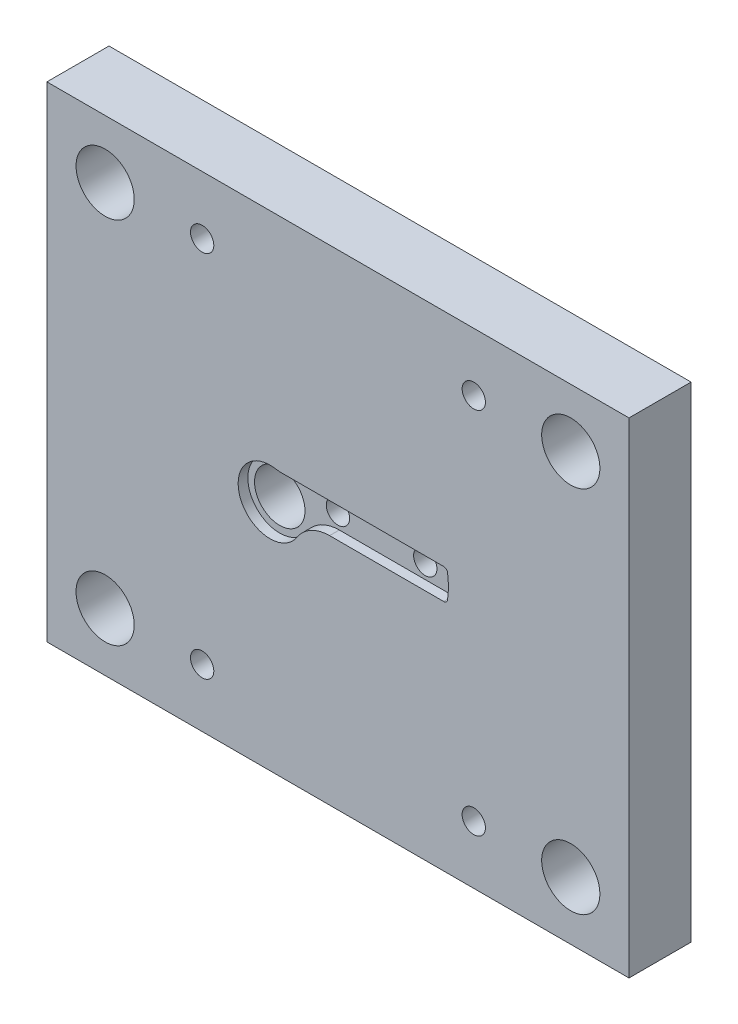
from build123d import *

# Parameters (mm, degrees)
ESQUISSE1_W              = 300
ESQUISSE1_H              = 250
BASE_EXTRUSION_DEPTH     = 32
ENL_V_MAT_EXTRU_1_DEPTH  = 5
ESQUISSE3_R              = 13
ENL_V_MAT_EXTRU_2_DEPTH  = 392.444759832
ESQUISSE6_R              = 6
ENL_V_MAT_EXTRU_5_DEPTH  = 13
ESQUISSE7_R              = 9
ENL_V_MAT_EXTRU_6_DEPTH  = 391.927103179
ESQUISSE8_R              = 15
ENL_V_MAT_EXTRU_7_DEPTH  = 22
ESQUISSE9_R              = 23
ENL_V_MAT_EXTRU_8_DEPTH  = 392.131691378
ESQUISSE10_R             = 10
ENL_V_MAT_EXTRU_9_DEPTH  = 21.5
ESQUISSE11_R             = 6
ENL_V_MAT_EXTRU_10_DEPTH = 392.103886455


with BuildPart() as part:
    # Esquisse1 → Base-Extrusion (new body)
    with BuildSketch(Plane.XY):
        with Locations((150, 125)):
            Rectangle(ESQUISSE1_W, ESQUISSE1_H)
    extrude(amount=BASE_EXTRUSION_DEPTH)

    # Esquisse2 → Enl_v. mat.-Extru.1 (cut)
    with BuildSketch(Plane.XY.offset(32)):
        with BuildLine():
            Line((121.07819052, 135.935), (204.489847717, 135.935))
            ThreePointArc((204.489847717, 135.935), (205.861295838, 135.401672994), (206.512122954, 134.081926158))
            Line((206.512122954, 134.081926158), (207.033723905, 128.12))
            Line((207.033723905, 128.12), (206.512122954, 122.158073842))
            ThreePointArc((206.512122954, 122.158073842), (205.861295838, 120.838327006), (204.489847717, 120.305))
            Line((204.489847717, 120.305), (145.681427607, 120.305))
            ThreePointArc((145.681427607, 120.305), (136.083538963, 117.855711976), (128.832928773, 111.106850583))
            ThreePointArc((128.832928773, 111.106850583), (99.957582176, 113.354423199), (117.740393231, 136.215063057))
            ThreePointArc((117.740393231, 136.215063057), (119.403427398, 136.005138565), (121.07819052, 135.935))
        make_face()
    extrude(amount=-ENL_V_MAT_EXTRU_1_DEPTH, mode=Mode.SUBTRACT)

    # Esquisse3 → Enl_v. mat.-Extru.2 (cut, through all)
    with BuildSketch(Plane.XY.offset(27)):
        with Locations((115, 120)):
            Circle(ESQUISSE3_R)
    extrude(amount=-ENL_V_MAT_EXTRU_2_DEPTH, mode=Mode.SUBTRACT)

    # Esquisse6 → Enl_v. mat.-Extru.5 (cut)
    with BuildSketch(Plane.XY.offset(27)):
        with Locations((190, 128.12)):
            Circle(ESQUISSE6_R)
        with Locations((145, 128.12)):
            Circle(ESQUISSE6_R)
    extrude(amount=-ENL_V_MAT_EXTRU_5_DEPTH, mode=Mode.SUBTRACT)

    # Esquisse7 → Enl_v. mat.-Extru.6 (cut, through all)
    with BuildSketch(Plane.XY.offset(14)):
        with Locations((190, 128.12)):
            Circle(ESQUISSE7_R)
        with Locations((145, 128.12)):
            Circle(ESQUISSE7_R)
    extrude(amount=-ENL_V_MAT_EXTRU_6_DEPTH, mode=Mode.SUBTRACT)

    # Esquisse8 → Enl_v. mat.-Extru.7 (cut)
    with BuildSketch(Plane.XY.offset(32)):
        with Locations((30, 220)):
            Circle(ESQUISSE8_R)
        with Locations((30, 30)):
            Circle(ESQUISSE8_R)
        with Locations((270, 30)):
            Circle(ESQUISSE8_R)
        with Locations((270, 220)):
            Circle(ESQUISSE8_R)
    extrude(amount=-ENL_V_MAT_EXTRU_7_DEPTH, mode=Mode.SUBTRACT)

    # Esquisse9 → Enl_v. mat.-Extru.8 (cut, through all)
    with BuildSketch(Plane.XY.offset(10)):
        with Locations((30, 220)):
            Circle(ESQUISSE9_R)
        with Locations((270, 220)):
            Circle(ESQUISSE9_R)
        with Locations((270, 30)):
            Circle(ESQUISSE9_R)
        with Locations((30, 30)):
            Circle(ESQUISSE9_R)
    extrude(amount=-ENL_V_MAT_EXTRU_8_DEPTH, mode=Mode.SUBTRACT)

    # Esquisse10 → Enl_v. mat.-Extru.9 (cut)
    with BuildSketch(Plane(origin=(0, 0, 0), x_dir=(-1, 0, 0), z_dir=(0, 0, -1))):
        with Locations((-220, 220)):
            Circle(ESQUISSE10_R)
        with Locations((-80, 220)):
            Circle(ESQUISSE10_R)
        with Locations((-80, 30)):
            Circle(ESQUISSE10_R)
        with Locations((-220, 30)):
            Circle(ESQUISSE10_R)
    extrude(amount=-ENL_V_MAT_EXTRU_9_DEPTH, mode=Mode.SUBTRACT)

    # Esquisse11 → Enl_v. mat.-Extru.10 (cut, through all)
    with BuildSketch(Plane(origin=(0, 0, 21.5), x_dir=(-1, 0, 0), z_dir=(0, 0, -1))):
        with Locations((-220, 220)):
            Circle(ESQUISSE11_R)
        with Locations((-80, 220)):
            Circle(ESQUISSE11_R)
        with Locations((-80, 30)):
            Circle(ESQUISSE11_R)
        with Locations((-220, 30)):
            Circle(ESQUISSE11_R)
    extrude(amount=-ENL_V_MAT_EXTRU_10_DEPTH, mode=Mode.SUBTRACT)


solid = part.part
